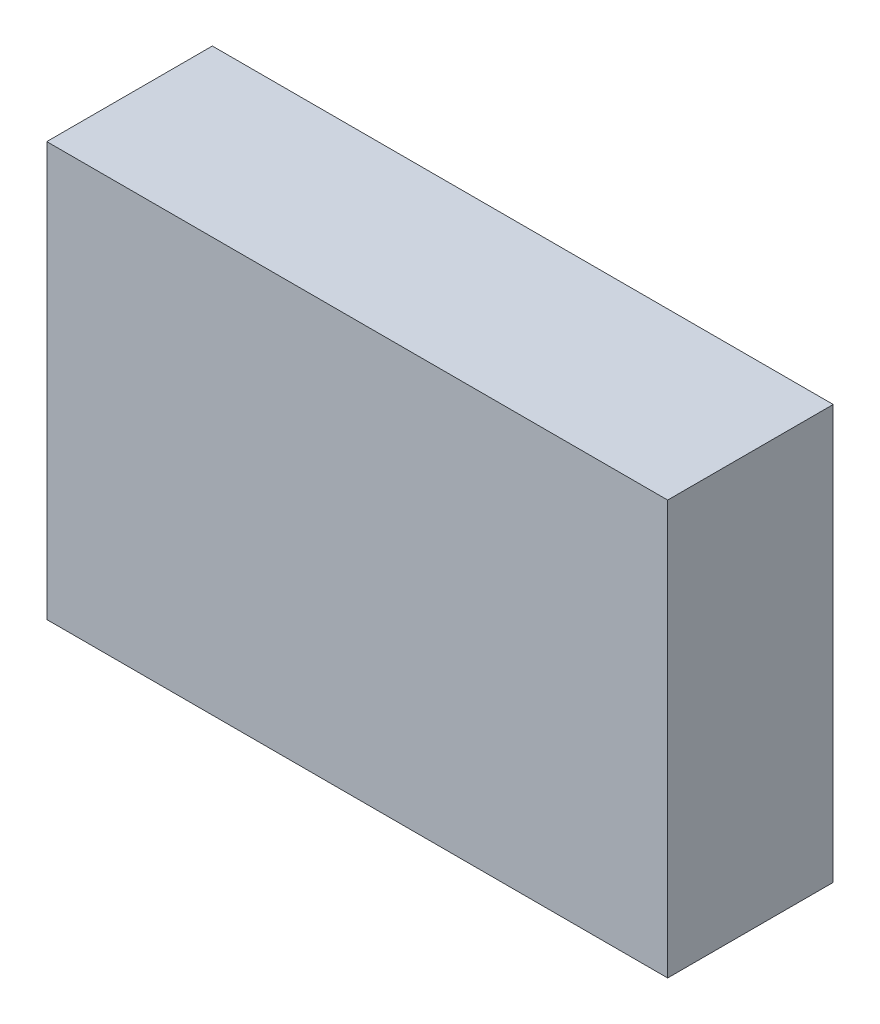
ISO-10303-21;
HEADER;
FILE_DESCRIPTION(('STEP AP214'),'2;1');
FILE_NAME('part.step','',(''),(''),'','','');
FILE_SCHEMA(('AUTOMOTIVE_DESIGN { 1 0 10303 214 1 1 1 1 }'));
ENDSEC;
DATA;
#1=APPLICATION_CONTEXT('core data for automotive mechanical design processes');
#2=APPLICATION_PROTOCOL_DEFINITION('international standard','automotive_design',2000,#1);
#3=PRODUCT_CONTEXT('',#1,'mechanical');
#4=PRODUCT('Part','Part','',(#3));
#5=PRODUCT_RELATED_PRODUCT_CATEGORY('part','',(#4));
#6=PRODUCT_DEFINITION_FORMATION('','',#4);
#7=PRODUCT_DEFINITION_CONTEXT('part definition',#1,'design');
#8=PRODUCT_DEFINITION('design','',#6,#7);
#9=PRODUCT_DEFINITION_SHAPE('','',#8);
#10=(LENGTH_UNIT() NAMED_UNIT(*) SI_UNIT(.MILLI.,.METRE.));
#11=(NAMED_UNIT(*) PLANE_ANGLE_UNIT() SI_UNIT($,.RADIAN.));
#12=(NAMED_UNIT(*) SI_UNIT($,.STERADIAN.) SOLID_ANGLE_UNIT());
#13=UNCERTAINTY_MEASURE_WITH_UNIT(LENGTH_MEASURE(1.E-05),#10,'distance_accuracy_value','');
#14=(GEOMETRIC_REPRESENTATION_CONTEXT(3) GLOBAL_UNCERTAINTY_ASSIGNED_CONTEXT((#13)) GLOBAL_UNIT_ASSIGNED_CONTEXT((#10,
#11,#12)) REPRESENTATION_CONTEXT('',''));
#15=CARTESIAN_POINT('',(0.,0.,0.));
#16=DIRECTION('',(0.,0.,1.));
#17=DIRECTION('',(1.,0.,0.));
#18=AXIS2_PLACEMENT_3D('',#15,#16,#17);
#19=CARTESIAN_POINT('',(0.,0.,0.80000094));
#20=DIRECTION('',(0.,0.,1.));
#21=DIRECTION('',(1.,0.,0.));
#22=AXIS2_PLACEMENT_3D('',#19,#20,#21);
#23=PLANE('',#22);
#24=DIRECTION('',(1.,0.,0.));
#25=VECTOR('',#24,1.);
#26=CARTESIAN_POINT('',(-1.5000224,-0.99998784,0.80000094));
#27=LINE('',#26,#25);
#28=CARTESIAN_POINT('',(-1.5000224,-0.99998784,0.80000094));
#29=VERTEX_POINT('',#28);
#30=CARTESIAN_POINT('',(1.5000224,-0.99998784,0.80000094));
#31=VERTEX_POINT('',#30);
#32=EDGE_CURVE('E83',#29,#31,#27,.T.);
#33=ORIENTED_EDGE('',*,*,#32,.T.);
#34=DIRECTION('',(0.,1.,0.));
#35=VECTOR('',#34,1.);
#36=CARTESIAN_POINT('',(1.5000224,-0.99998784,0.80000094));
#37=LINE('',#36,#35);
#38=CARTESIAN_POINT('',(1.5000224,0.99998784,0.80000094));
#39=VERTEX_POINT('',#38);
#40=EDGE_CURVE('E107',#31,#39,#37,.T.);
#41=ORIENTED_EDGE('',*,*,#40,.T.);
#42=DIRECTION('',(-1.,0.,0.));
#43=VECTOR('',#42,1.);
#44=CARTESIAN_POINT('',(1.5000224,0.99998784,0.80000094));
#45=LINE('',#44,#43);
#46=CARTESIAN_POINT('',(-1.5000224,0.99998784,0.80000094));
#47=VERTEX_POINT('',#46);
#48=EDGE_CURVE('E20',#39,#47,#45,.T.);
#49=ORIENTED_EDGE('',*,*,#48,.T.);
#50=DIRECTION('',(0.,-1.,0.));
#51=VECTOR('',#50,1.);
#52=CARTESIAN_POINT('',(-1.5000224,0.99998784,0.80000094));
#53=LINE('',#52,#51);
#54=EDGE_CURVE('E11',#47,#29,#53,.T.);
#55=ORIENTED_EDGE('',*,*,#54,.T.);
#56=EDGE_LOOP('',(#33,#41,#49,#55));
#57=FACE_BOUND('',#56,.T.);
#58=ADVANCED_FACE('F17',(#57),#23,.T.);
#59=CARTESIAN_POINT('',(0.,0.,0.));
#60=DIRECTION('',(0.,0.,1.));
#61=DIRECTION('',(1.,0.,0.));
#62=AXIS2_PLACEMENT_3D('',#59,#60,#61);
#63=PLANE('',#62);
#64=DIRECTION('',(0.,-1.,0.));
#65=VECTOR('',#64,1.);
#66=CARTESIAN_POINT('',(-1.5000224,0.99998784,0.));
#67=LINE('',#66,#65);
#68=CARTESIAN_POINT('',(-1.5000224,0.99998784,0.));
#69=VERTEX_POINT('',#68);
#70=CARTESIAN_POINT('',(-1.5000224,-0.99998784,0.));
#71=VERTEX_POINT('',#70);
#72=EDGE_CURVE('E26',#69,#71,#67,.T.);
#73=ORIENTED_EDGE('',*,*,#72,.F.);
#74=DIRECTION('',(-1.,0.,0.));
#75=VECTOR('',#74,1.);
#76=CARTESIAN_POINT('',(1.5000224,0.99998784,0.));
#77=LINE('',#76,#75);
#78=CARTESIAN_POINT('',(1.5000224,0.99998784,0.));
#79=VERTEX_POINT('',#78);
#80=EDGE_CURVE('E111',#79,#69,#77,.T.);
#81=ORIENTED_EDGE('',*,*,#80,.F.);
#82=DIRECTION('',(0.,1.,0.));
#83=VECTOR('',#82,1.);
#84=CARTESIAN_POINT('',(1.5000224,-0.99998784,0.));
#85=LINE('',#84,#83);
#86=CARTESIAN_POINT('',(1.5000224,-0.99998784,0.));
#87=VERTEX_POINT('',#86);
#88=EDGE_CURVE('E85',#87,#79,#85,.T.);
#89=ORIENTED_EDGE('',*,*,#88,.F.);
#90=DIRECTION('',(1.,0.,0.));
#91=VECTOR('',#90,1.);
#92=CARTESIAN_POINT('',(-1.5000224,-0.99998784,0.));
#93=LINE('',#92,#91);
#94=EDGE_CURVE('E81',#71,#87,#93,.T.);
#95=ORIENTED_EDGE('',*,*,#94,.F.);
#96=EDGE_LOOP('',(#73,#81,#89,#95));
#97=FACE_BOUND('',#96,.T.);
#98=ADVANCED_FACE('F87',(#97),#63,.F.);
#99=CARTESIAN_POINT('',(-1.5000224,0.99998784,0.));
#100=DIRECTION('',(1.,0.,0.));
#101=DIRECTION('',(0.,1.,0.));
#102=AXIS2_PLACEMENT_3D('',#99,#100,#101);
#103=PLANE('',#102);
#104=ORIENTED_EDGE('',*,*,#72,.T.);
#105=DIRECTION('',(0.,0.,1.));
#106=VECTOR('',#105,1.);
#107=CARTESIAN_POINT('',(-1.5000224,-0.99998784,0.));
#108=LINE('',#107,#106);
#109=EDGE_CURVE('E70',#71,#29,#108,.T.);
#110=ORIENTED_EDGE('',*,*,#109,.T.);
#111=ORIENTED_EDGE('',*,*,#54,.F.);
#112=DIRECTION('',(0.,0.,1.));
#113=VECTOR('',#112,1.);
#114=CARTESIAN_POINT('',(-1.5000224,0.99998784,0.));
#115=LINE('',#114,#113);
#116=EDGE_CURVE('E73',#69,#47,#115,.T.);
#117=ORIENTED_EDGE('',*,*,#116,.F.);
#118=EDGE_LOOP('',(#104,#110,#111,#117));
#119=FACE_BOUND('',#118,.T.);
#120=ADVANCED_FACE('F69',(#119),#103,.F.);
#121=CARTESIAN_POINT('',(1.5000224,0.99998784,0.));
#122=DIRECTION('',(0.,-1.,0.));
#123=DIRECTION('',(0.,0.,-1.));
#124=AXIS2_PLACEMENT_3D('',#121,#122,#123);
#125=PLANE('',#124);
#126=ORIENTED_EDGE('',*,*,#80,.T.);
#127=ORIENTED_EDGE('',*,*,#116,.T.);
#128=ORIENTED_EDGE('',*,*,#48,.F.);
#129=DIRECTION('',(0.,0.,1.));
#130=VECTOR('',#129,1.);
#131=CARTESIAN_POINT('',(1.5000224,0.99998784,0.));
#132=LINE('',#131,#130);
#133=EDGE_CURVE('E104',#79,#39,#132,.T.);
#134=ORIENTED_EDGE('',*,*,#133,.F.);
#135=EDGE_LOOP('',(#126,#127,#128,#134));
#136=FACE_BOUND('',#135,.T.);
#137=ADVANCED_FACE('F124',(#136),#125,.F.);
#138=CARTESIAN_POINT('',(1.5000224,-0.99998784,0.));
#139=DIRECTION('',(-1.,0.,0.));
#140=DIRECTION('',(0.,0.,1.));
#141=AXIS2_PLACEMENT_3D('',#138,#139,#140);
#142=PLANE('',#141);
#143=ORIENTED_EDGE('',*,*,#88,.T.);
#144=ORIENTED_EDGE('',*,*,#133,.T.);
#145=ORIENTED_EDGE('',*,*,#40,.F.);
#146=DIRECTION('',(0.,0.,1.));
#147=VECTOR('',#146,1.);
#148=CARTESIAN_POINT('',(1.5000224,-0.99998784,0.));
#149=LINE('',#148,#147);
#150=EDGE_CURVE('E91',#87,#31,#149,.T.);
#151=ORIENTED_EDGE('',*,*,#150,.F.);
#152=EDGE_LOOP('',(#143,#144,#145,#151));
#153=FACE_BOUND('',#152,.T.);
#154=ADVANCED_FACE('F126',(#153),#142,.F.);
#155=CARTESIAN_POINT('',(-1.5000224,-0.99998784,0.));
#156=DIRECTION('',(0.,1.,0.));
#157=DIRECTION('',(1.,0.,0.));
#158=AXIS2_PLACEMENT_3D('',#155,#156,#157);
#159=PLANE('',#158);
#160=ORIENTED_EDGE('',*,*,#94,.T.);
#161=ORIENTED_EDGE('',*,*,#150,.T.);
#162=ORIENTED_EDGE('',*,*,#32,.F.);
#163=ORIENTED_EDGE('',*,*,#109,.F.);
#164=EDGE_LOOP('',(#160,#161,#162,#163));
#165=FACE_BOUND('',#164,.T.);
#166=ADVANCED_FACE('F79',(#165),#159,.F.);
#167=CLOSED_SHELL('',(#58,#98,#120,#137,#154,#166));
#168=MANIFOLD_SOLID_BREP('B1',#167);
#169=ADVANCED_BREP_SHAPE_REPRESENTATION('',(#18,#168),#14);
#170=SHAPE_DEFINITION_REPRESENTATION(#9,#169);
ENDSEC;
END-ISO-10303-21;
